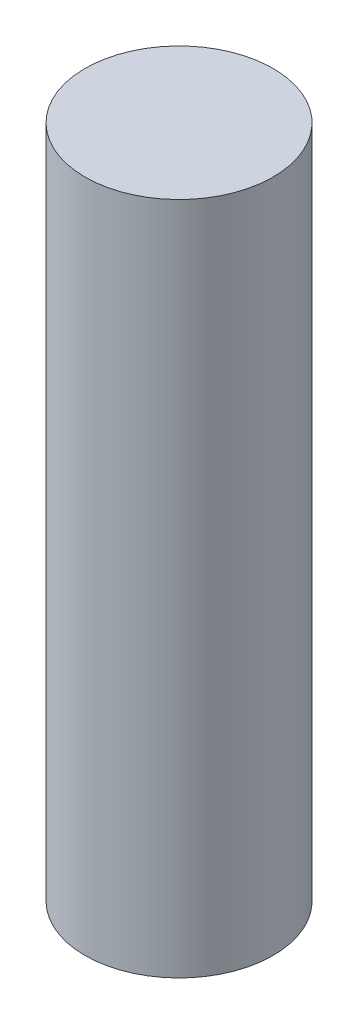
ISO-10303-21;
HEADER;
FILE_DESCRIPTION(('STEP AP214'),'2;1');
FILE_NAME('part.step','',(''),(''),'','','');
FILE_SCHEMA(('AUTOMOTIVE_DESIGN { 1 0 10303 214 1 1 1 1 }'));
ENDSEC;
DATA;
#1=APPLICATION_CONTEXT('core data for automotive mechanical design processes');
#2=APPLICATION_PROTOCOL_DEFINITION('international standard','automotive_design',2000,#1);
#3=PRODUCT_CONTEXT('',#1,'mechanical');
#4=PRODUCT('Part','Part','',(#3));
#5=PRODUCT_RELATED_PRODUCT_CATEGORY('part','',(#4));
#6=PRODUCT_DEFINITION_FORMATION('','',#4);
#7=PRODUCT_DEFINITION_CONTEXT('part definition',#1,'design');
#8=PRODUCT_DEFINITION('design','',#6,#7);
#9=PRODUCT_DEFINITION_SHAPE('','',#8);
#10=(LENGTH_UNIT() NAMED_UNIT(*) SI_UNIT(.MILLI.,.METRE.));
#11=(NAMED_UNIT(*) PLANE_ANGLE_UNIT() SI_UNIT($,.RADIAN.));
#12=(NAMED_UNIT(*) SI_UNIT($,.STERADIAN.) SOLID_ANGLE_UNIT());
#13=UNCERTAINTY_MEASURE_WITH_UNIT(LENGTH_MEASURE(1.E-05),#10,'distance_accuracy_value','');
#14=(GEOMETRIC_REPRESENTATION_CONTEXT(3) GLOBAL_UNCERTAINTY_ASSIGNED_CONTEXT((#13)) GLOBAL_UNIT_ASSIGNED_CONTEXT((#10,
#11,#12)) REPRESENTATION_CONTEXT('',''));
#15=CARTESIAN_POINT('',(0.,0.,0.));
#16=DIRECTION('',(0.,0.,1.));
#17=DIRECTION('',(1.,0.,0.));
#18=AXIS2_PLACEMENT_3D('',#15,#16,#17);
#19=CARTESIAN_POINT('',(0.,215.,0.));
#20=DIRECTION('',(0.,-1.,0.));
#21=DIRECTION('',(0.,0.,-1.));
#22=AXIS2_PLACEMENT_3D('',#19,#20,#21);
#23=CYLINDRICAL_SURFACE('',#22,30.);
#24=CARTESIAN_POINT('',(0.,215.,0.));
#25=DIRECTION('',(0.,1.,0.));
#26=DIRECTION('',(0.,0.,1.));
#27=AXIS2_PLACEMENT_3D('',#24,#25,#26);
#28=CIRCLE('',#27,30.);
#29=CARTESIAN_POINT('',(0.,215.,30.));
#30=VERTEX_POINT('',#29);
#31=EDGE_CURVE('E10',#30,#30,#28,.T.);
#32=ORIENTED_EDGE('',*,*,#31,.F.);
#33=EDGE_LOOP('',(#32));
#34=FACE_BOUND('',#33,.T.);
#35=CARTESIAN_POINT('',(0.,0.,0.));
#36=DIRECTION('',(0.,1.,0.));
#37=DIRECTION('',(0.,0.,1.));
#38=AXIS2_PLACEMENT_3D('',#35,#36,#37);
#39=CIRCLE('',#38,30.);
#40=CARTESIAN_POINT('',(0.,0.,30.));
#41=VERTEX_POINT('',#40);
#42=EDGE_CURVE('E46',#41,#41,#39,.T.);
#43=ORIENTED_EDGE('',*,*,#42,.T.);
#44=EDGE_LOOP('',(#43));
#45=FACE_BOUND('',#44,.T.);
#46=ADVANCED_FACE('F43',(#34,#45),#23,.T.);
#47=CARTESIAN_POINT('',(0.,215.,0.));
#48=DIRECTION('',(0.,1.,0.));
#49=DIRECTION('',(0.,0.,1.));
#50=AXIS2_PLACEMENT_3D('',#47,#48,#49);
#51=PLANE('',#50);
#52=ORIENTED_EDGE('',*,*,#31,.T.);
#53=EDGE_LOOP('',(#52));
#54=FACE_BOUND('',#53,.T.);
#55=ADVANCED_FACE('F60',(#54),#51,.T.);
#56=CARTESIAN_POINT('',(0.,0.,0.));
#57=DIRECTION('',(0.,1.,0.));
#58=DIRECTION('',(0.,0.,1.));
#59=AXIS2_PLACEMENT_3D('',#56,#57,#58);
#60=PLANE('',#59);
#61=ORIENTED_EDGE('',*,*,#42,.F.);
#62=EDGE_LOOP('',(#61));
#63=FACE_BOUND('',#62,.T.);
#64=ADVANCED_FACE('F58',(#63),#60,.F.);
#65=CLOSED_SHELL('',(#46,#55,#64));
#66=MANIFOLD_SOLID_BREP('B2',#65);
#67=ADVANCED_BREP_SHAPE_REPRESENTATION('',(#18,#66),#14);
#68=SHAPE_DEFINITION_REPRESENTATION(#9,#67);
ENDSEC;
END-ISO-10303-21;
